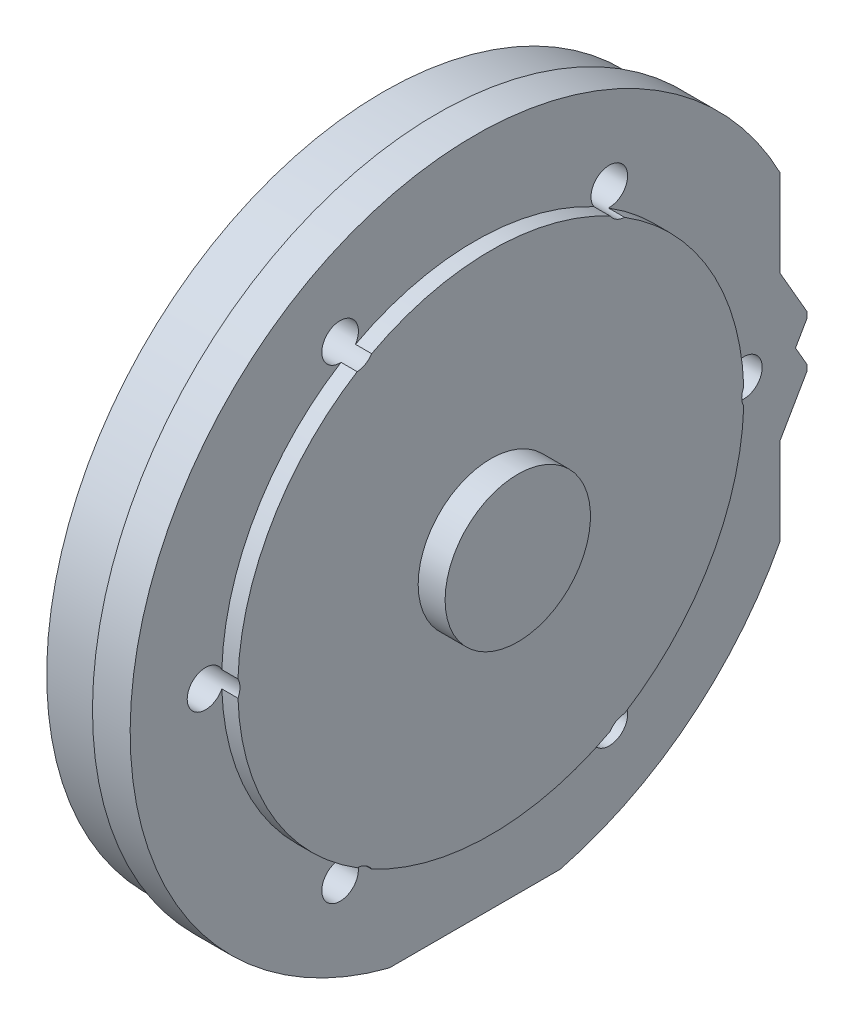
ISO-10303-21;
HEADER;
FILE_DESCRIPTION(('STEP AP214'),'2;1');
FILE_NAME('part.step','',(''),(''),'','','');
FILE_SCHEMA(('AUTOMOTIVE_DESIGN { 1 0 10303 214 1 1 1 1 }'));
ENDSEC;
DATA;
#1=APPLICATION_CONTEXT('core data for automotive mechanical design processes');
#2=APPLICATION_PROTOCOL_DEFINITION('international standard','automotive_design',2000,#1);
#3=PRODUCT_CONTEXT('',#1,'mechanical');
#4=PRODUCT('Part','Part','',(#3));
#5=PRODUCT_RELATED_PRODUCT_CATEGORY('part','',(#4));
#6=PRODUCT_DEFINITION_FORMATION('','',#4);
#7=PRODUCT_DEFINITION_CONTEXT('part definition',#1,'design');
#8=PRODUCT_DEFINITION('design','',#6,#7);
#9=PRODUCT_DEFINITION_SHAPE('','',#8);
#10=(LENGTH_UNIT() NAMED_UNIT(*) SI_UNIT(.MILLI.,.METRE.));
#11=(NAMED_UNIT(*) PLANE_ANGLE_UNIT() SI_UNIT($,.RADIAN.));
#12=(NAMED_UNIT(*) SI_UNIT($,.STERADIAN.) SOLID_ANGLE_UNIT());
#13=UNCERTAINTY_MEASURE_WITH_UNIT(LENGTH_MEASURE(1.E-05),#10,'distance_accuracy_value','');
#14=(GEOMETRIC_REPRESENTATION_CONTEXT(3) GLOBAL_UNCERTAINTY_ASSIGNED_CONTEXT((#13)) GLOBAL_UNIT_ASSIGNED_CONTEXT((#10,
#11,#12)) REPRESENTATION_CONTEXT('',''));
#15=CARTESIAN_POINT('',(0.,0.,0.));
#16=DIRECTION('',(0.,0.,1.));
#17=DIRECTION('',(1.,0.,0.));
#18=AXIS2_PLACEMENT_3D('',#15,#16,#17);
#19=CARTESIAN_POINT('',(0.,0.,0.));
#20=DIRECTION('',(1.,0.,0.));
#21=DIRECTION('',(0.,0.,-1.));
#22=AXIS2_PLACEMENT_3D('',#19,#20,#21);
#23=PLANE('',#22);
#24=CARTESIAN_POINT('',(0.,0.,0.));
#25=DIRECTION('',(-1.,0.,0.));
#26=DIRECTION('',(0.,0.,1.));
#27=AXIS2_PLACEMENT_3D('',#24,#25,#26);
#28=CIRCLE('',#27,31.5);
#29=CARTESIAN_POINT('',(0.,0.,31.5));
#30=VERTEX_POINT('',#29);
#31=EDGE_CURVE('E451',#30,#30,#28,.T.);
#32=ORIENTED_EDGE('',*,*,#31,.F.);
#33=EDGE_LOOP('',(#32));
#34=FACE_BOUND('',#33,.T.);
#35=CARTESIAN_POINT('',(0.,50.,0.));
#36=DIRECTION('',(-1.,0.,0.));
#37=DIRECTION('',(0.,0.,1.));
#38=AXIS2_PLACEMENT_3D('',#35,#36,#37);
#39=CIRCLE('',#38,4.);
#40=CARTESIAN_POINT('',(0.,50.,4.));
#41=VERTEX_POINT('',#40);
#42=EDGE_CURVE('E439',#41,#41,#39,.T.);
#43=ORIENTED_EDGE('',*,*,#42,.F.);
#44=EDGE_LOOP('',(#43));
#45=FACE_BOUND('',#44,.T.);
#46=CARTESIAN_POINT('',(0.,0.,-50.));
#47=DIRECTION('',(-1.,0.,0.));
#48=DIRECTION('',(0.,0.,1.));
#49=AXIS2_PLACEMENT_3D('',#46,#47,#48);
#50=CIRCLE('',#49,3.4);
#51=CARTESIAN_POINT('',(0.,0.,-46.6));
#52=VERTEX_POINT('',#51);
#53=EDGE_CURVE('E423',#52,#52,#50,.T.);
#54=ORIENTED_EDGE('',*,*,#53,.F.);
#55=EDGE_LOOP('',(#54));
#56=FACE_BOUND('',#55,.T.);
#57=CARTESIAN_POINT('',(0.,43.3012701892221,-25.));
#58=DIRECTION('',(-1.,0.,0.));
#59=DIRECTION('',(0.,0.,1.));
#60=AXIS2_PLACEMENT_3D('',#57,#58,#59);
#61=CIRCLE('',#60,3.4);
#62=CARTESIAN_POINT('',(0.,43.3012701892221,-21.6));
#63=VERTEX_POINT('',#62);
#64=EDGE_CURVE('E407',#63,#63,#61,.T.);
#65=ORIENTED_EDGE('',*,*,#64,.F.);
#66=EDGE_LOOP('',(#65));
#67=FACE_BOUND('',#66,.T.);
#68=CARTESIAN_POINT('',(0.,43.3012701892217,25.));
#69=DIRECTION('',(-1.,0.,0.));
#70=DIRECTION('',(0.,0.,1.));
#71=AXIS2_PLACEMENT_3D('',#68,#69,#70);
#72=CIRCLE('',#71,3.4);
#73=CARTESIAN_POINT('',(0.,43.3012701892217,28.4));
#74=VERTEX_POINT('',#73);
#75=EDGE_CURVE('E391',#74,#74,#72,.T.);
#76=ORIENTED_EDGE('',*,*,#75,.F.);
#77=EDGE_LOOP('',(#76));
#78=FACE_BOUND('',#77,.T.);
#79=CARTESIAN_POINT('',(0.,-4.44089209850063E-13,50.));
#80=DIRECTION('',(-1.,0.,0.));
#81=DIRECTION('',(0.,0.,1.));
#82=AXIS2_PLACEMENT_3D('',#79,#80,#81);
#83=CIRCLE('',#82,3.4);
#84=CARTESIAN_POINT('',(0.,-4.44089209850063E-13,53.4));
#85=VERTEX_POINT('',#84);
#86=EDGE_CURVE('E376',#85,#85,#83,.T.);
#87=ORIENTED_EDGE('',*,*,#86,.F.);
#88=EDGE_LOOP('',(#87));
#89=FACE_BOUND('',#88,.T.);
#90=CARTESIAN_POINT('',(0.,-43.3012701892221,24.9999999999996));
#91=DIRECTION('',(-1.,0.,0.));
#92=DIRECTION('',(0.,0.,1.));
#93=AXIS2_PLACEMENT_3D('',#90,#91,#92);
#94=CIRCLE('',#93,3.4);
#95=CARTESIAN_POINT('',(0.,-43.3012701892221,28.3999999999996));
#96=VERTEX_POINT('',#95);
#97=EDGE_CURVE('E364',#96,#96,#94,.T.);
#98=ORIENTED_EDGE('',*,*,#97,.F.);
#99=EDGE_LOOP('',(#98));
#100=FACE_BOUND('',#99,.T.);
#101=CARTESIAN_POINT('',(0.,-43.3012701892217,-25.0000000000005));
#102=DIRECTION('',(-1.,0.,0.));
#103=DIRECTION('',(0.,0.,1.));
#104=AXIS2_PLACEMENT_3D('',#101,#102,#103);
#105=CIRCLE('',#104,3.4);
#106=CARTESIAN_POINT('',(0.,-43.3012701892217,-21.6000000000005));
#107=VERTEX_POINT('',#106);
#108=EDGE_CURVE('E348',#107,#107,#105,.T.);
#109=ORIENTED_EDGE('',*,*,#108,.F.);
#110=EDGE_LOOP('',(#109));
#111=FACE_BOUND('',#110,.T.);
#112=DIRECTION('',(0.,-1.,0.));
#113=VECTOR('',#112,1.);
#114=CARTESIAN_POINT('',(0.,-13.4102540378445,-56.75));
#115=LINE('',#114,#113);
#116=CARTESIAN_POINT('',(0.,-13.4102540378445,-56.75));
#117=VERTEX_POINT('',#116);
#118=CARTESIAN_POINT('',(0.,-26.1856353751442,-56.75));
#119=VERTEX_POINT('',#118);
#120=EDGE_CURVE('E289',#117,#119,#115,.T.);
#121=ORIENTED_EDGE('',*,*,#120,.T.);
#122=CARTESIAN_POINT('',(0.,0.,0.));
#123=DIRECTION('',(-1.,0.,0.));
#124=DIRECTION('',(0.,0.,1.));
#125=AXIS2_PLACEMENT_3D('',#122,#123,#124);
#126=CIRCLE('',#125,62.5);
#127=CARTESIAN_POINT('',(0.,-62.,-7.88986691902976));
#128=VERTEX_POINT('',#127);
#129=EDGE_CURVE('E489',#119,#128,#126,.T.);
#130=ORIENTED_EDGE('',*,*,#129,.T.);
#131=DIRECTION('',(0.,0.,1.));
#132=VECTOR('',#131,1.);
#133=CARTESIAN_POINT('',(0.,-62.,25.));
#134=LINE('',#133,#132);
#135=CARTESIAN_POINT('',(0.,-62.,7.88986691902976));
#136=VERTEX_POINT('',#135);
#137=EDGE_CURVE('E331',#128,#136,#134,.T.);
#138=ORIENTED_EDGE('',*,*,#137,.T.);
#139=CARTESIAN_POINT('',(0.,26.1856353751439,-56.75));
#140=VERTEX_POINT('',#139);
#141=EDGE_CURVE('E263',#136,#140,#126,.T.);
#142=ORIENTED_EDGE('',*,*,#141,.T.);
#143=DIRECTION('',(0.,-1.,0.));
#144=VECTOR('',#143,1.);
#145=CARTESIAN_POINT('',(0.,29.5877930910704,-56.75));
#146=LINE('',#145,#144);
#147=CARTESIAN_POINT('',(0.,13.4102540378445,-56.75));
#148=VERTEX_POINT('',#147);
#149=EDGE_CURVE('E241',#140,#148,#146,.T.);
#150=ORIENTED_EDGE('',*,*,#149,.T.);
#151=DIRECTION('',(0.,-0.866025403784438,-0.5));
#152=VECTOR('',#151,1.);
#153=CARTESIAN_POINT('',(0.,13.4102540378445,-56.75));
#154=LINE('',#153,#152);
#155=CARTESIAN_POINT('',(0.,4.75,-61.75));
#156=VERTEX_POINT('',#155);
#157=EDGE_CURVE('E250',#148,#156,#154,.T.);
#158=ORIENTED_EDGE('',*,*,#157,.T.);
#159=DIRECTION('',(0.,-1.,0.));
#160=VECTOR('',#159,1.);
#161=CARTESIAN_POINT('',(0.,4.75,-61.75));
#162=LINE('',#161,#160);
#163=CARTESIAN_POINT('',(0.,3.75000000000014,-61.75));
#164=VERTEX_POINT('',#163);
#165=EDGE_CURVE('E257',#156,#164,#162,.T.);
#166=ORIENTED_EDGE('',*,*,#165,.T.);
#167=DIRECTION('',(0.,-0.866025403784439,0.5));
#168=VECTOR('',#167,1.);
#169=CARTESIAN_POINT('',(0.,3.75000000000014,-61.75));
#170=LINE('',#169,#168);
#171=CARTESIAN_POINT('',(0.,0.,-59.5849364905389));
#172=VERTEX_POINT('',#171);
#173=EDGE_CURVE('E273',#164,#172,#170,.T.);
#174=ORIENTED_EDGE('',*,*,#173,.T.);
#175=DIRECTION('',(0.,-0.866025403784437,-0.5));
#176=VECTOR('',#175,1.);
#177=CARTESIAN_POINT('',(0.,0.,-59.5849364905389));
#178=LINE('',#177,#176);
#179=CARTESIAN_POINT('',(0.,-3.75000000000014,-61.75));
#180=VERTEX_POINT('',#179);
#181=EDGE_CURVE('E277',#172,#180,#178,.T.);
#182=ORIENTED_EDGE('',*,*,#181,.T.);
#183=DIRECTION('',(0.,-1.,0.));
#184=VECTOR('',#183,1.);
#185=CARTESIAN_POINT('',(0.,-3.75000000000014,-61.75));
#186=LINE('',#185,#184);
#187=CARTESIAN_POINT('',(0.,-4.75,-61.75));
#188=VERTEX_POINT('',#187);
#189=EDGE_CURVE('E281',#180,#188,#186,.T.);
#190=ORIENTED_EDGE('',*,*,#189,.T.);
#191=DIRECTION('',(0.,-0.866025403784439,0.5));
#192=VECTOR('',#191,1.);
#193=CARTESIAN_POINT('',(0.,-4.75,-61.75));
#194=LINE('',#193,#192);
#195=EDGE_CURVE('E285',#188,#117,#194,.T.);
#196=ORIENTED_EDGE('',*,*,#195,.T.);
#197=EDGE_LOOP('',(#121,#130,#138,#142,#150,#158,#166,#174,#182,#190,#196));
#198=FACE_BOUND('',#197,.T.);
#199=ADVANCED_FACE('F15',(#34,#45,#56,#67,#78,#89,#100,#111,#198),#23,.F.);
#200=CARTESIAN_POINT('',(0.,0.,0.));
#201=DIRECTION('',(-1.,0.,0.));
#202=DIRECTION('',(0.,0.,1.));
#203=AXIS2_PLACEMENT_3D('',#200,#201,#202);
#204=CYLINDRICAL_SURFACE('',#203,62.5);
#205=DIRECTION('',(-1.,0.,0.));
#206=VECTOR('',#205,1.);
#207=CARTESIAN_POINT('',(0.,-26.1856353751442,-56.75));
#208=LINE('',#207,#206);
#209=CARTESIAN_POINT('',(10.,-26.1856353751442,-56.75));
#210=VERTEX_POINT('',#209);
#211=EDGE_CURVE('E328',#210,#119,#208,.T.);
#212=ORIENTED_EDGE('',*,*,#211,.F.);
#213=CARTESIAN_POINT('',(10.,0.,0.));
#214=DIRECTION('',(-1.,0.,0.));
#215=DIRECTION('',(0.,0.,1.));
#216=AXIS2_PLACEMENT_3D('',#213,#214,#215);
#217=CIRCLE('',#216,62.5);
#218=CARTESIAN_POINT('',(10.,-62.,-7.88986691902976));
#219=VERTEX_POINT('',#218);
#220=EDGE_CURVE('E484',#210,#219,#217,.T.);
#221=ORIENTED_EDGE('',*,*,#220,.T.);
#222=DIRECTION('',(-1.,0.,0.));
#223=VECTOR('',#222,1.);
#224=CARTESIAN_POINT('',(0.,-62.,-7.88986691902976));
#225=LINE('',#224,#223);
#226=EDGE_CURVE('E345',#219,#128,#225,.T.);
#227=ORIENTED_EDGE('',*,*,#226,.T.);
#228=ORIENTED_EDGE('',*,*,#129,.F.);
#229=EDGE_LOOP('',(#212,#221,#227,#228));
#230=FACE_BOUND('',#229,.T.);
#231=ADVANCED_FACE('F590',(#230),#204,.T.);
#232=DIRECTION('',(-1.,0.,0.));
#233=VECTOR('',#232,1.);
#234=CARTESIAN_POINT('',(0.,26.1856353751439,-56.75));
#235=LINE('',#234,#233);
#236=CARTESIAN_POINT('',(10.,26.1856353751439,-56.75));
#237=VERTEX_POINT('',#236);
#238=EDGE_CURVE('E322',#140,#237,#235,.F.);
#239=ORIENTED_EDGE('',*,*,#238,.F.);
#240=ORIENTED_EDGE('',*,*,#141,.F.);
#241=DIRECTION('',(-1.,0.,0.));
#242=VECTOR('',#241,1.);
#243=CARTESIAN_POINT('',(0.,-62.,7.88986691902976));
#244=LINE('',#243,#242);
#245=CARTESIAN_POINT('',(10.,-62.,7.88986691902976));
#246=VERTEX_POINT('',#245);
#247=EDGE_CURVE('E339',#136,#246,#244,.F.);
#248=ORIENTED_EDGE('',*,*,#247,.T.);
#249=EDGE_CURVE('E485',#246,#237,#217,.T.);
#250=ORIENTED_EDGE('',*,*,#249,.T.);
#251=EDGE_LOOP('',(#239,#240,#248,#250));
#252=FACE_BOUND('',#251,.T.);
#253=ADVANCED_FACE('F597',(#252),#204,.T.);
#254=CARTESIAN_POINT('',(10.,62.5,0.));
#255=DIRECTION('',(1.,0.,0.));
#256=DIRECTION('',(0.,0.,-1.));
#257=AXIS2_PLACEMENT_3D('',#254,#255,#256);
#258=PLANE('',#257);
#259=DIRECTION('',(0.,1.,0.));
#260=VECTOR('',#259,1.);
#261=CARTESIAN_POINT('',(10.,62.5,-56.75));
#262=LINE('',#261,#260);
#263=CARTESIAN_POINT('',(10.,-29.5877930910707,-56.75));
#264=VERTEX_POINT('',#263);
#265=EDGE_CURVE('E325',#264,#210,#262,.T.);
#266=ORIENTED_EDGE('',*,*,#265,.F.);
#267=CARTESIAN_POINT('',(10.,0.,0.));
#268=DIRECTION('',(-1.,0.,0.));
#269=DIRECTION('',(0.,0.,1.));
#270=AXIS2_PLACEMENT_3D('',#267,#268,#269);
#271=CIRCLE('',#270,64.);
#272=CARTESIAN_POINT('',(10.,-62.,-15.8745078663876));
#273=VERTEX_POINT('',#272);
#274=EDGE_CURVE('E479',#264,#273,#271,.T.);
#275=ORIENTED_EDGE('',*,*,#274,.T.);
#276=DIRECTION('',(0.,0.,1.));
#277=VECTOR('',#276,1.);
#278=CARTESIAN_POINT('',(10.,-62.,0.));
#279=LINE('',#278,#277);
#280=EDGE_CURVE('E340',#273,#219,#279,.T.);
#281=ORIENTED_EDGE('',*,*,#280,.T.);
#282=ORIENTED_EDGE('',*,*,#220,.F.);
#283=EDGE_LOOP('',(#266,#275,#281,#282));
#284=FACE_BOUND('',#283,.T.);
#285=ADVANCED_FACE('F685',(#284),#258,.F.);
#286=DIRECTION('',(0.,1.,0.));
#287=VECTOR('',#286,1.);
#288=CARTESIAN_POINT('',(10.,62.5,-56.75));
#289=LINE('',#288,#287);
#290=CARTESIAN_POINT('',(10.,29.5877930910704,-56.75));
#291=VERTEX_POINT('',#290);
#292=EDGE_CURVE('E319',#237,#291,#289,.T.);
#293=ORIENTED_EDGE('',*,*,#292,.F.);
#294=ORIENTED_EDGE('',*,*,#249,.F.);
#295=CARTESIAN_POINT('',(10.,-62.,15.8745078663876));
#296=VERTEX_POINT('',#295);
#297=EDGE_CURVE('E336',#246,#296,#279,.T.);
#298=ORIENTED_EDGE('',*,*,#297,.T.);
#299=EDGE_CURVE('E480',#296,#291,#271,.T.);
#300=ORIENTED_EDGE('',*,*,#299,.T.);
#301=EDGE_LOOP('',(#293,#294,#298,#300));
#302=FACE_BOUND('',#301,.T.);
#303=ADVANCED_FACE('F684',(#302),#258,.F.);
#304=CARTESIAN_POINT('',(0.,0.,0.));
#305=DIRECTION('',(-1.,0.,0.));
#306=DIRECTION('',(0.,0.,1.));
#307=AXIS2_PLACEMENT_3D('',#304,#305,#306);
#308=CYLINDRICAL_SURFACE('',#307,64.);
#309=DIRECTION('',(-1.,0.,0.));
#310=VECTOR('',#309,1.);
#311=CARTESIAN_POINT('',(76.6180551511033,-29.5877930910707,-56.75));
#312=LINE('',#311,#310);
#313=CARTESIAN_POINT('',(17.,-29.5877930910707,-56.75));
#314=VERTEX_POINT('',#313);
#315=EDGE_CURVE('E292',#314,#264,#312,.T.);
#316=ORIENTED_EDGE('',*,*,#315,.F.);
#317=CARTESIAN_POINT('',(17.,0.,0.));
#318=DIRECTION('',(-1.,0.,0.));
#319=DIRECTION('',(0.,0.,1.));
#320=AXIS2_PLACEMENT_3D('',#317,#318,#319);
#321=CIRCLE('',#320,64.);
#322=CARTESIAN_POINT('',(17.,-62.,-15.8745078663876));
#323=VERTEX_POINT('',#322);
#324=EDGE_CURVE('E41',#314,#323,#321,.T.);
#325=ORIENTED_EDGE('',*,*,#324,.T.);
#326=DIRECTION('',(-1.,0.,0.));
#327=VECTOR('',#326,1.);
#328=CARTESIAN_POINT('',(0.,-62.,-15.8745078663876));
#329=LINE('',#328,#327);
#330=EDGE_CURVE('E343',#323,#273,#329,.T.);
#331=ORIENTED_EDGE('',*,*,#330,.T.);
#332=ORIENTED_EDGE('',*,*,#274,.F.);
#333=EDGE_LOOP('',(#316,#325,#331,#332));
#334=FACE_BOUND('',#333,.T.);
#335=ADVANCED_FACE('F679',(#334),#308,.T.);
#336=DIRECTION('',(-1.,0.,0.));
#337=VECTOR('',#336,1.);
#338=CARTESIAN_POINT('',(76.6180551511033,29.5877930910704,-56.75));
#339=LINE('',#338,#337);
#340=CARTESIAN_POINT('',(17.,29.5877930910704,-56.75));
#341=VERTEX_POINT('',#340);
#342=EDGE_CURVE('E33',#341,#291,#339,.T.);
#343=ORIENTED_EDGE('',*,*,#342,.T.);
#344=ORIENTED_EDGE('',*,*,#299,.F.);
#345=DIRECTION('',(-1.,0.,0.));
#346=VECTOR('',#345,1.);
#347=CARTESIAN_POINT('',(0.,-62.,15.8745078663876));
#348=LINE('',#347,#346);
#349=CARTESIAN_POINT('',(17.,-62.,15.8745078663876));
#350=VERTEX_POINT('',#349);
#351=EDGE_CURVE('E333',#296,#350,#348,.F.);
#352=ORIENTED_EDGE('',*,*,#351,.T.);
#353=EDGE_CURVE('E475',#350,#341,#321,.T.);
#354=ORIENTED_EDGE('',*,*,#353,.T.);
#355=EDGE_LOOP('',(#343,#344,#352,#354));
#356=FACE_BOUND('',#355,.T.);
#357=ADVANCED_FACE('F677',(#356),#308,.T.);
#358=CARTESIAN_POINT('',(17.,64.,0.));
#359=DIRECTION('',(-1.,0.,0.));
#360=DIRECTION('',(0.,0.,1.));
#361=AXIS2_PLACEMENT_3D('',#358,#359,#360);
#362=PLANE('',#361);
#363=CARTESIAN_POINT('',(17.,0.,0.));
#364=DIRECTION('',(-1.,0.,0.));
#365=DIRECTION('',(0.,0.,1.));
#366=AXIS2_PLACEMENT_3D('',#363,#364,#365);
#367=CIRCLE('',#366,47.);
#368=CARTESIAN_POINT('',(17.,-1.5510463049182,-46.9744));
#369=VERTEX_POINT('',#368);
#370=CARTESIAN_POINT('',(17.,-39.9055005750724,-24.8304455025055));
#371=VERTEX_POINT('',#370);
#372=EDGE_CURVE('E470',#369,#371,#367,.T.);
#373=ORIENTED_EDGE('',*,*,#372,.T.);
#374=CARTESIAN_POINT('',(17.,-43.3012701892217,-25.0000000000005));
#375=DIRECTION('',(-1.,0.,0.));
#376=DIRECTION('',(0.,0.,1.));
#377=AXIS2_PLACEMENT_3D('',#374,#375,#376);
#378=CIRCLE('',#377,3.4);
#379=CARTESIAN_POINT('',(17.,-41.4565468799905,-22.1439544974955));
#380=VERTEX_POINT('',#379);
#381=EDGE_CURVE('E360',#371,#380,#378,.T.);
#382=ORIENTED_EDGE('',*,*,#381,.T.);
#383=CARTESIAN_POINT('',(17.,-41.456546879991,22.1439544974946));
#384=VERTEX_POINT('',#383);
#385=EDGE_CURVE('E474',#380,#384,#367,.T.);
#386=ORIENTED_EDGE('',*,*,#385,.T.);
#387=CARTESIAN_POINT('',(17.,-43.3012701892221,24.9999999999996));
#388=DIRECTION('',(-1.,0.,0.));
#389=DIRECTION('',(0.,0.,1.));
#390=AXIS2_PLACEMENT_3D('',#387,#388,#389);
#391=CIRCLE('',#390,3.4);
#392=CARTESIAN_POINT('',(17.,-39.9055005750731,24.8304455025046));
#393=VERTEX_POINT('',#392);
#394=EDGE_CURVE('E373',#384,#393,#391,.T.);
#395=ORIENTED_EDGE('',*,*,#394,.T.);
#396=CARTESIAN_POINT('',(17.,-1.5510463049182,46.9744));
#397=VERTEX_POINT('',#396);
#398=EDGE_CURVE('E538',#393,#397,#367,.T.);
#399=ORIENTED_EDGE('',*,*,#398,.T.);
#400=CARTESIAN_POINT('',(17.,-4.44089209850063E-13,50.));
#401=DIRECTION('',(-1.,0.,0.));
#402=DIRECTION('',(0.,0.,1.));
#403=AXIS2_PLACEMENT_3D('',#400,#401,#402);
#404=CIRCLE('',#403,3.4);
#405=CARTESIAN_POINT('',(17.,1.55104630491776,46.9744));
#406=VERTEX_POINT('',#405);
#407=EDGE_CURVE('E387',#397,#406,#404,.T.);
#408=ORIENTED_EDGE('',*,*,#407,.T.);
#409=CARTESIAN_POINT('',(17.,39.9055005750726,24.8304455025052));
#410=VERTEX_POINT('',#409);
#411=EDGE_CURVE('E534',#406,#410,#367,.T.);
#412=ORIENTED_EDGE('',*,*,#411,.T.);
#413=CARTESIAN_POINT('',(17.,43.3012701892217,25.));
#414=DIRECTION('',(-1.,0.,0.));
#415=DIRECTION('',(0.,0.,1.));
#416=AXIS2_PLACEMENT_3D('',#413,#414,#415);
#417=CIRCLE('',#416,3.4);
#418=CARTESIAN_POINT('',(17.,41.4565468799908,22.1439544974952));
#419=VERTEX_POINT('',#418);
#420=EDGE_CURVE('E403',#410,#419,#417,.T.);
#421=ORIENTED_EDGE('',*,*,#420,.T.);
#422=CARTESIAN_POINT('',(17.,41.4565468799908,-22.1439544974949));
#423=VERTEX_POINT('',#422);
#424=EDGE_CURVE('E532',#419,#423,#367,.T.);
#425=ORIENTED_EDGE('',*,*,#424,.T.);
#426=CARTESIAN_POINT('',(17.,43.3012701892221,-25.));
#427=DIRECTION('',(-1.,0.,0.));
#428=DIRECTION('',(0.,0.,1.));
#429=AXIS2_PLACEMENT_3D('',#426,#427,#428);
#430=CIRCLE('',#429,3.4);
#431=CARTESIAN_POINT('',(17.,39.9055005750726,-24.8304455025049));
#432=VERTEX_POINT('',#431);
#433=EDGE_CURVE('E419',#423,#432,#430,.T.);
#434=ORIENTED_EDGE('',*,*,#433,.T.);
#435=CARTESIAN_POINT('',(17.,1.5510463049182,-46.9744));
#436=VERTEX_POINT('',#435);
#437=EDGE_CURVE('E468',#432,#436,#367,.T.);
#438=ORIENTED_EDGE('',*,*,#437,.T.);
#439=CARTESIAN_POINT('',(17.,0.,-50.));
#440=DIRECTION('',(-1.,0.,0.));
#441=DIRECTION('',(0.,0.,1.));
#442=AXIS2_PLACEMENT_3D('',#439,#440,#441);
#443=CIRCLE('',#442,3.4);
#444=EDGE_CURVE('E435',#436,#369,#443,.T.);
#445=ORIENTED_EDGE('',*,*,#444,.T.);
#446=EDGE_LOOP('',(#373,#382,#386,#395,#399,#408,#412,#421,#425,#434,#438,#445));
#447=FACE_BOUND('',#446,.T.);
#448=DIRECTION('',(0.,1.,0.));
#449=VECTOR('',#448,1.);
#450=CARTESIAN_POINT('',(17.,-13.4102540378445,-56.75));
#451=LINE('',#450,#449);
#452=CARTESIAN_POINT('',(17.,-13.4102540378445,-56.75));
#453=VERTEX_POINT('',#452);
#454=EDGE_CURVE('E314',#314,#453,#451,.T.);
#455=ORIENTED_EDGE('',*,*,#454,.T.);
#456=DIRECTION('',(0.,0.866025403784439,-0.5));
#457=VECTOR('',#456,1.);
#458=CARTESIAN_POINT('',(17.,-4.75,-61.75));
#459=LINE('',#458,#457);
#460=CARTESIAN_POINT('',(17.,-4.75,-61.75));
#461=VERTEX_POINT('',#460);
#462=EDGE_CURVE('E318',#453,#461,#459,.T.);
#463=ORIENTED_EDGE('',*,*,#462,.T.);
#464=DIRECTION('',(0.,1.,0.));
#465=VECTOR('',#464,1.);
#466=CARTESIAN_POINT('',(17.,-3.75000000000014,-61.75));
#467=LINE('',#466,#465);
#468=CARTESIAN_POINT('',(17.,-3.75000000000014,-61.75));
#469=VERTEX_POINT('',#468);
#470=EDGE_CURVE('E730',#461,#469,#467,.T.);
#471=ORIENTED_EDGE('',*,*,#470,.T.);
#472=DIRECTION('',(0.,0.866025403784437,0.5));
#473=VECTOR('',#472,1.);
#474=CARTESIAN_POINT('',(17.,0.,-59.5849364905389));
#475=LINE('',#474,#473);
#476=CARTESIAN_POINT('',(17.,0.,-59.5849364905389));
#477=VERTEX_POINT('',#476);
#478=EDGE_CURVE('E723',#469,#477,#475,.T.);
#479=ORIENTED_EDGE('',*,*,#478,.T.);
#480=DIRECTION('',(0.,0.866025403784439,-0.5));
#481=VECTOR('',#480,1.);
#482=CARTESIAN_POINT('',(17.,3.75000000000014,-61.75));
#483=LINE('',#482,#481);
#484=CARTESIAN_POINT('',(17.,3.75000000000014,-61.75));
#485=VERTEX_POINT('',#484);
#486=EDGE_CURVE('E719',#477,#485,#483,.T.);
#487=ORIENTED_EDGE('',*,*,#486,.T.);
#488=DIRECTION('',(0.,1.,0.));
#489=VECTOR('',#488,1.);
#490=CARTESIAN_POINT('',(17.,4.75,-61.75));
#491=LINE('',#490,#489);
#492=CARTESIAN_POINT('',(17.,4.75,-61.75));
#493=VERTEX_POINT('',#492);
#494=EDGE_CURVE('E715',#485,#493,#491,.T.);
#495=ORIENTED_EDGE('',*,*,#494,.T.);
#496=DIRECTION('',(0.,0.866025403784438,0.5));
#497=VECTOR('',#496,1.);
#498=CARTESIAN_POINT('',(17.,13.4102540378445,-56.75));
#499=LINE('',#498,#497);
#500=CARTESIAN_POINT('',(17.,13.4102540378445,-56.75));
#501=VERTEX_POINT('',#500);
#502=EDGE_CURVE('E718',#493,#501,#499,.T.);
#503=ORIENTED_EDGE('',*,*,#502,.T.);
#504=DIRECTION('',(0.,1.,0.));
#505=VECTOR('',#504,1.);
#506=CARTESIAN_POINT('',(17.,29.5877930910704,-56.75));
#507=LINE('',#506,#505);
#508=EDGE_CURVE('E243',#501,#341,#507,.T.);
#509=ORIENTED_EDGE('',*,*,#508,.T.);
#510=ORIENTED_EDGE('',*,*,#353,.F.);
#511=DIRECTION('',(0.,0.,-1.));
#512=VECTOR('',#511,1.);
#513=CARTESIAN_POINT('',(17.,-62.,0.));
#514=LINE('',#513,#512);
#515=EDGE_CURVE('E10',#350,#323,#514,.T.);
#516=ORIENTED_EDGE('',*,*,#515,.T.);
#517=ORIENTED_EDGE('',*,*,#324,.F.);
#518=EDGE_LOOP('',(#455,#463,#471,#479,#487,#495,#503,#509,#510,#516,#517));
#519=FACE_BOUND('',#518,.T.);
#520=ADVANCED_FACE('F526',(#447,#519),#362,.F.);
#521=CARTESIAN_POINT('',(0.,0.,0.));
#522=DIRECTION('',(-1.,0.,0.));
#523=DIRECTION('',(0.,0.,1.));
#524=AXIS2_PLACEMENT_3D('',#521,#522,#523);
#525=CYLINDRICAL_SURFACE('',#524,47.);
#526=ORIENTED_EDGE('',*,*,#385,.F.);
#527=DIRECTION('',(-1.,0.,0.));
#528=VECTOR('',#527,1.);
#529=CARTESIAN_POINT('',(12.5,-41.4565468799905,-22.1439544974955));
#530=LINE('',#529,#528);
#531=CARTESIAN_POINT('',(20.,-41.4565468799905,-22.1439544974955));
#532=VERTEX_POINT('',#531);
#533=EDGE_CURVE('E356',#380,#532,#530,.F.);
#534=ORIENTED_EDGE('',*,*,#533,.T.);
#535=CARTESIAN_POINT('',(20.,0.,0.));
#536=DIRECTION('',(-1.,0.,0.));
#537=DIRECTION('',(0.,0.,1.));
#538=AXIS2_PLACEMENT_3D('',#535,#536,#537);
#539=CIRCLE('',#538,47.);
#540=CARTESIAN_POINT('',(20.,-41.456546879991,22.1439544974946));
#541=VERTEX_POINT('',#540);
#542=EDGE_CURVE('E469',#532,#541,#539,.T.);
#543=ORIENTED_EDGE('',*,*,#542,.T.);
#544=DIRECTION('',(-1.,0.,0.));
#545=VECTOR('',#544,1.);
#546=CARTESIAN_POINT('',(12.5,-41.456546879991,22.1439544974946));
#547=LINE('',#546,#545);
#548=EDGE_CURVE('E367',#541,#384,#547,.T.);
#549=ORIENTED_EDGE('',*,*,#548,.T.);
#550=EDGE_LOOP('',(#526,#534,#543,#549));
#551=FACE_BOUND('',#550,.T.);
#552=ADVANCED_FACE('F552',(#551),#525,.T.);
#553=ORIENTED_EDGE('',*,*,#398,.F.);
#554=DIRECTION('',(-1.,0.,0.));
#555=VECTOR('',#554,1.);
#556=CARTESIAN_POINT('',(12.5,-39.9055005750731,24.8304455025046));
#557=LINE('',#556,#555);
#558=CARTESIAN_POINT('',(20.,-39.9055005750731,24.8304455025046));
#559=VERTEX_POINT('',#558);
#560=EDGE_CURVE('E370',#393,#559,#557,.F.);
#561=ORIENTED_EDGE('',*,*,#560,.T.);
#562=CARTESIAN_POINT('',(20.,-1.5510463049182,46.9744));
#563=VERTEX_POINT('',#562);
#564=EDGE_CURVE('E554',#559,#563,#539,.T.);
#565=ORIENTED_EDGE('',*,*,#564,.T.);
#566=DIRECTION('',(-1.,0.,0.));
#567=VECTOR('',#566,1.);
#568=CARTESIAN_POINT('',(12.5,-1.5510463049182,46.9744));
#569=LINE('',#568,#567);
#570=EDGE_CURVE('E380',#563,#397,#569,.T.);
#571=ORIENTED_EDGE('',*,*,#570,.T.);
#572=EDGE_LOOP('',(#553,#561,#565,#571));
#573=FACE_BOUND('',#572,.T.);
#574=ADVANCED_FACE('F579',(#573),#525,.T.);
#575=ORIENTED_EDGE('',*,*,#411,.F.);
#576=DIRECTION('',(-1.,0.,0.));
#577=VECTOR('',#576,1.);
#578=CARTESIAN_POINT('',(12.5,1.55104630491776,46.9744));
#579=LINE('',#578,#577);
#580=CARTESIAN_POINT('',(20.,1.55104630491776,46.9744));
#581=VERTEX_POINT('',#580);
#582=EDGE_CURVE('E383',#406,#581,#579,.F.);
#583=ORIENTED_EDGE('',*,*,#582,.T.);
#584=CARTESIAN_POINT('',(20.,39.9055005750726,24.8304455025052));
#585=VERTEX_POINT('',#584);
#586=EDGE_CURVE('E555',#581,#585,#539,.T.);
#587=ORIENTED_EDGE('',*,*,#586,.T.);
#588=DIRECTION('',(-1.,0.,0.));
#589=VECTOR('',#588,1.);
#590=CARTESIAN_POINT('',(12.5,39.9055005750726,24.8304455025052));
#591=LINE('',#590,#589);
#592=EDGE_CURVE('E395',#585,#410,#591,.T.);
#593=ORIENTED_EDGE('',*,*,#592,.T.);
#594=EDGE_LOOP('',(#575,#583,#587,#593));
#595=FACE_BOUND('',#594,.T.);
#596=ADVANCED_FACE('F577',(#595),#525,.T.);
#597=ORIENTED_EDGE('',*,*,#424,.F.);
#598=DIRECTION('',(-1.,0.,0.));
#599=VECTOR('',#598,1.);
#600=CARTESIAN_POINT('',(12.5,41.4565468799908,22.1439544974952));
#601=LINE('',#600,#599);
#602=CARTESIAN_POINT('',(20.,41.4565468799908,22.1439544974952));
#603=VERTEX_POINT('',#602);
#604=EDGE_CURVE('E399',#419,#603,#601,.F.);
#605=ORIENTED_EDGE('',*,*,#604,.T.);
#606=CARTESIAN_POINT('',(20.,41.4565468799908,-22.1439544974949));
#607=VERTEX_POINT('',#606);
#608=EDGE_CURVE('E560',#603,#607,#539,.T.);
#609=ORIENTED_EDGE('',*,*,#608,.T.);
#610=DIRECTION('',(-1.,0.,0.));
#611=VECTOR('',#610,1.);
#612=CARTESIAN_POINT('',(12.5,41.4565468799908,-22.1439544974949));
#613=LINE('',#612,#611);
#614=EDGE_CURVE('E411',#607,#423,#613,.T.);
#615=ORIENTED_EDGE('',*,*,#614,.T.);
#616=EDGE_LOOP('',(#597,#605,#609,#615));
#617=FACE_BOUND('',#616,.T.);
#618=ADVANCED_FACE('F572',(#617),#525,.T.);
#619=ORIENTED_EDGE('',*,*,#437,.F.);
#620=DIRECTION('',(-1.,0.,0.));
#621=VECTOR('',#620,1.);
#622=CARTESIAN_POINT('',(12.5,39.9055005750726,-24.8304455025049));
#623=LINE('',#622,#621);
#624=CARTESIAN_POINT('',(20.,39.9055005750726,-24.8304455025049));
#625=VERTEX_POINT('',#624);
#626=EDGE_CURVE('E415',#432,#625,#623,.F.);
#627=ORIENTED_EDGE('',*,*,#626,.T.);
#628=CARTESIAN_POINT('',(20.,1.5510463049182,-46.9744));
#629=VERTEX_POINT('',#628);
#630=EDGE_CURVE('E463',#625,#629,#539,.T.);
#631=ORIENTED_EDGE('',*,*,#630,.T.);
#632=DIRECTION('',(-1.,0.,0.));
#633=VECTOR('',#632,1.);
#634=CARTESIAN_POINT('',(12.5,1.5510463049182,-46.9744));
#635=LINE('',#634,#633);
#636=EDGE_CURVE('E427',#629,#436,#635,.T.);
#637=ORIENTED_EDGE('',*,*,#636,.T.);
#638=EDGE_LOOP('',(#619,#627,#631,#637));
#639=FACE_BOUND('',#638,.T.);
#640=ADVANCED_FACE('F569',(#639),#525,.T.);
#641=CARTESIAN_POINT('',(20.,-1.5510463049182,-46.9744));
#642=VERTEX_POINT('',#641);
#643=CARTESIAN_POINT('',(20.,-39.9055005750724,-24.8304455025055));
#644=VERTEX_POINT('',#643);
#645=EDGE_CURVE('E464',#642,#644,#539,.T.);
#646=ORIENTED_EDGE('',*,*,#645,.T.);
#647=DIRECTION('',(-1.,0.,0.));
#648=VECTOR('',#647,1.);
#649=CARTESIAN_POINT('',(12.5,-39.9055005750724,-24.8304455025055));
#650=LINE('',#649,#648);
#651=EDGE_CURVE('E352',#644,#371,#650,.T.);
#652=ORIENTED_EDGE('',*,*,#651,.T.);
#653=ORIENTED_EDGE('',*,*,#372,.F.);
#654=DIRECTION('',(-1.,0.,0.));
#655=VECTOR('',#654,1.);
#656=CARTESIAN_POINT('',(12.5,-1.5510463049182,-46.9744));
#657=LINE('',#656,#655);
#658=EDGE_CURVE('E431',#369,#642,#657,.F.);
#659=ORIENTED_EDGE('',*,*,#658,.T.);
#660=EDGE_LOOP('',(#646,#652,#653,#659));
#661=FACE_BOUND('',#660,.T.);
#662=ADVANCED_FACE('F519',(#661),#525,.T.);
#663=CARTESIAN_POINT('',(20.,47.,0.));
#664=DIRECTION('',(-1.,0.,0.));
#665=DIRECTION('',(0.,0.,1.));
#666=AXIS2_PLACEMENT_3D('',#663,#664,#665);
#667=PLANE('',#666);
#668=ORIENTED_EDGE('',*,*,#542,.F.);
#669=CARTESIAN_POINT('',(20.,-43.3012701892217,-25.0000000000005));
#670=DIRECTION('',(-1.,0.,0.));
#671=DIRECTION('',(0.,0.,1.));
#672=AXIS2_PLACEMENT_3D('',#669,#670,#671);
#673=CIRCLE('',#672,3.4);
#674=EDGE_CURVE('E22',#532,#644,#673,.T.);
#675=ORIENTED_EDGE('',*,*,#674,.T.);
#676=ORIENTED_EDGE('',*,*,#645,.F.);
#677=CARTESIAN_POINT('',(20.,0.,-50.));
#678=DIRECTION('',(-1.,0.,0.));
#679=DIRECTION('',(0.,0.,1.));
#680=AXIS2_PLACEMENT_3D('',#677,#678,#679);
#681=CIRCLE('',#680,3.4);
#682=EDGE_CURVE('E492',#642,#629,#681,.T.);
#683=ORIENTED_EDGE('',*,*,#682,.T.);
#684=ORIENTED_EDGE('',*,*,#630,.F.);
#685=CARTESIAN_POINT('',(20.,43.3012701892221,-25.));
#686=DIRECTION('',(-1.,0.,0.));
#687=DIRECTION('',(0.,0.,1.));
#688=AXIS2_PLACEMENT_3D('',#685,#686,#687);
#689=CIRCLE('',#688,3.4);
#690=EDGE_CURVE('E496',#625,#607,#689,.T.);
#691=ORIENTED_EDGE('',*,*,#690,.T.);
#692=ORIENTED_EDGE('',*,*,#608,.F.);
#693=CARTESIAN_POINT('',(20.,43.3012701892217,25.));
#694=DIRECTION('',(-1.,0.,0.));
#695=DIRECTION('',(0.,0.,1.));
#696=AXIS2_PLACEMENT_3D('',#693,#694,#695);
#697=CIRCLE('',#696,3.4);
#698=EDGE_CURVE('E500',#603,#585,#697,.T.);
#699=ORIENTED_EDGE('',*,*,#698,.T.);
#700=ORIENTED_EDGE('',*,*,#586,.F.);
#701=CARTESIAN_POINT('',(20.,-4.44089209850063E-13,50.));
#702=DIRECTION('',(-1.,0.,0.));
#703=DIRECTION('',(0.,0.,1.));
#704=AXIS2_PLACEMENT_3D('',#701,#702,#703);
#705=CIRCLE('',#704,3.4);
#706=EDGE_CURVE('E504',#581,#563,#705,.T.);
#707=ORIENTED_EDGE('',*,*,#706,.T.);
#708=ORIENTED_EDGE('',*,*,#564,.F.);
#709=CARTESIAN_POINT('',(20.,-43.3012701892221,24.9999999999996));
#710=DIRECTION('',(-1.,0.,0.));
#711=DIRECTION('',(0.,0.,1.));
#712=AXIS2_PLACEMENT_3D('',#709,#710,#711);
#713=CIRCLE('',#712,3.4);
#714=EDGE_CURVE('E507',#559,#541,#713,.T.);
#715=ORIENTED_EDGE('',*,*,#714,.T.);
#716=EDGE_LOOP('',(#668,#675,#676,#683,#684,#691,#692,#699,#700,#707,#708,#715));
#717=FACE_BOUND('',#716,.T.);
#718=CARTESIAN_POINT('',(20.,0.,0.));
#719=DIRECTION('',(-1.,0.,0.));
#720=DIRECTION('',(0.,0.,1.));
#721=AXIS2_PLACEMENT_3D('',#718,#719,#720);
#722=CIRCLE('',#721,13.5);
#723=CARTESIAN_POINT('',(20.,0.,13.5));
#724=VERTEX_POINT('',#723);
#725=EDGE_CURVE('E459',#724,#724,#722,.T.);
#726=ORIENTED_EDGE('',*,*,#725,.T.);
#727=EDGE_LOOP('',(#726));
#728=FACE_BOUND('',#727,.T.);
#729=ADVANCED_FACE('F515',(#717,#728),#667,.F.);
#730=CARTESIAN_POINT('',(0.,0.,0.));
#731=DIRECTION('',(-1.,0.,0.));
#732=DIRECTION('',(0.,0.,1.));
#733=AXIS2_PLACEMENT_3D('',#730,#731,#732);
#734=CYLINDRICAL_SURFACE('',#733,13.5);
#735=ORIENTED_EDGE('',*,*,#725,.F.);
#736=EDGE_LOOP('',(#735));
#737=FACE_BOUND('',#736,.T.);
#738=CARTESIAN_POINT('',(25.,0.,0.));
#739=DIRECTION('',(-1.,0.,0.));
#740=DIRECTION('',(0.,0.,1.));
#741=AXIS2_PLACEMENT_3D('',#738,#739,#740);
#742=CIRCLE('',#741,13.5);
#743=CARTESIAN_POINT('',(25.,0.,13.5));
#744=VERTEX_POINT('',#743);
#745=EDGE_CURVE('E455',#744,#744,#742,.T.);
#746=ORIENTED_EDGE('',*,*,#745,.T.);
#747=EDGE_LOOP('',(#746));
#748=FACE_BOUND('',#747,.T.);
#749=ADVANCED_FACE('F662',(#737,#748),#734,.T.);
#750=CARTESIAN_POINT('',(25.,13.5,0.));
#751=DIRECTION('',(-1.,0.,0.));
#752=DIRECTION('',(0.,0.,1.));
#753=AXIS2_PLACEMENT_3D('',#750,#751,#752);
#754=PLANE('',#753);
#755=ORIENTED_EDGE('',*,*,#745,.F.);
#756=EDGE_LOOP('',(#755));
#757=FACE_BOUND('',#756,.T.);
#758=ADVANCED_FACE('F658',(#757),#754,.F.);
#759=CARTESIAN_POINT('',(0.,0.,0.));
#760=DIRECTION('',(-1.,0.,0.));
#761=DIRECTION('',(0.,0.,1.));
#762=AXIS2_PLACEMENT_3D('',#759,#760,#761);
#763=CYLINDRICAL_SURFACE('',#762,31.5);
#764=ORIENTED_EDGE('',*,*,#31,.T.);
#765=EDGE_LOOP('',(#764));
#766=FACE_BOUND('',#765,.T.);
#767=CARTESIAN_POINT('',(6.9999999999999,0.,0.));
#768=DIRECTION('',(-1.,0.,0.));
#769=DIRECTION('',(0.,0.,1.));
#770=AXIS2_PLACEMENT_3D('',#767,#768,#769);
#771=CIRCLE('',#770,31.5);
#772=CARTESIAN_POINT('',(6.9999999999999,0.,31.5));
#773=VERTEX_POINT('',#772);
#774=EDGE_CURVE('E447',#773,#773,#771,.T.);
#775=ORIENTED_EDGE('',*,*,#774,.F.);
#776=EDGE_LOOP('',(#775));
#777=FACE_BOUND('',#776,.T.);
#778=ADVANCED_FACE('F654',(#766,#777),#763,.F.);
#779=CARTESIAN_POINT('',(6.9999999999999,31.5,0.));
#780=DIRECTION('',(-1.,0.,0.));
#781=DIRECTION('',(0.,0.,1.));
#782=AXIS2_PLACEMENT_3D('',#779,#780,#781);
#783=PLANE('',#782);
#784=ORIENTED_EDGE('',*,*,#774,.T.);
#785=EDGE_LOOP('',(#784));
#786=FACE_BOUND('',#785,.T.);
#787=ADVANCED_FACE('F650',(#786),#783,.T.);
#788=CARTESIAN_POINT('',(12.,50.,0.));
#789=DIRECTION('',(-1.,0.,0.));
#790=DIRECTION('',(0.,0.,1.));
#791=AXIS2_PLACEMENT_3D('',#788,#789,#790);
#792=CONICAL_SURFACE('',#791,4.,1.02974425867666);
#793=CARTESIAN_POINT('',(14.4034424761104,50.,0.));
#794=VERTEX_POINT('',#793);
#795=VERTEX_LOOP('',#794);
#796=FACE_BOUND('',#795,.T.);
#797=CARTESIAN_POINT('',(12.,50.,0.));
#798=DIRECTION('',(-1.,0.,0.));
#799=DIRECTION('',(0.,0.,1.));
#800=AXIS2_PLACEMENT_3D('',#797,#798,#799);
#801=CIRCLE('',#800,4.);
#802=CARTESIAN_POINT('',(12.,50.,4.));
#803=VERTEX_POINT('',#802);
#804=EDGE_CURVE('E443',#803,#803,#801,.T.);
#805=ORIENTED_EDGE('',*,*,#804,.T.);
#806=EDGE_LOOP('',(#805));
#807=FACE_BOUND('',#806,.T.);
#808=ADVANCED_FACE('F646',(#796,#807),#792,.F.);
#809=CARTESIAN_POINT('',(0.,50.,0.));
#810=DIRECTION('',(-1.,0.,0.));
#811=DIRECTION('',(0.,0.,1.));
#812=AXIS2_PLACEMENT_3D('',#809,#810,#811);
#813=CYLINDRICAL_SURFACE('',#812,4.);
#814=ORIENTED_EDGE('',*,*,#804,.F.);
#815=EDGE_LOOP('',(#814));
#816=FACE_BOUND('',#815,.T.);
#817=ORIENTED_EDGE('',*,*,#42,.T.);
#818=EDGE_LOOP('',(#817));
#819=FACE_BOUND('',#818,.T.);
#820=ADVANCED_FACE('F642',(#816,#819),#813,.F.);
#821=CARTESIAN_POINT('',(0.,0.,-50.));
#822=DIRECTION('',(-1.,0.,0.));
#823=DIRECTION('',(0.,0.,1.));
#824=AXIS2_PLACEMENT_3D('',#821,#822,#823);
#825=CYLINDRICAL_SURFACE('',#824,3.4);
#826=ORIENTED_EDGE('',*,*,#53,.T.);
#827=EDGE_LOOP('',(#826));
#828=FACE_BOUND('',#827,.T.);
#829=ORIENTED_EDGE('',*,*,#636,.F.);
#830=ORIENTED_EDGE('',*,*,#682,.F.);
#831=ORIENTED_EDGE('',*,*,#658,.F.);
#832=ORIENTED_EDGE('',*,*,#444,.F.);
#833=EDGE_LOOP('',(#829,#830,#831,#832));
#834=FACE_BOUND('',#833,.T.);
#835=ADVANCED_FACE('F524',(#828,#834),#825,.F.);
#836=CARTESIAN_POINT('',(0.,43.3012701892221,-25.));
#837=DIRECTION('',(-1.,0.,0.));
#838=DIRECTION('',(0.,0.,1.));
#839=AXIS2_PLACEMENT_3D('',#836,#837,#838);
#840=CYLINDRICAL_SURFACE('',#839,3.4);
#841=ORIENTED_EDGE('',*,*,#64,.T.);
#842=EDGE_LOOP('',(#841));
#843=FACE_BOUND('',#842,.T.);
#844=ORIENTED_EDGE('',*,*,#614,.F.);
#845=ORIENTED_EDGE('',*,*,#690,.F.);
#846=ORIENTED_EDGE('',*,*,#626,.F.);
#847=ORIENTED_EDGE('',*,*,#433,.F.);
#848=EDGE_LOOP('',(#844,#845,#846,#847));
#849=FACE_BOUND('',#848,.T.);
#850=ADVANCED_FACE('F571',(#843,#849),#840,.F.);
#851=CARTESIAN_POINT('',(0.,43.3012701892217,25.));
#852=DIRECTION('',(-1.,0.,0.));
#853=DIRECTION('',(0.,0.,1.));
#854=AXIS2_PLACEMENT_3D('',#851,#852,#853);
#855=CYLINDRICAL_SURFACE('',#854,3.4);
#856=ORIENTED_EDGE('',*,*,#75,.T.);
#857=EDGE_LOOP('',(#856));
#858=FACE_BOUND('',#857,.T.);
#859=ORIENTED_EDGE('',*,*,#592,.F.);
#860=ORIENTED_EDGE('',*,*,#698,.F.);
#861=ORIENTED_EDGE('',*,*,#604,.F.);
#862=ORIENTED_EDGE('',*,*,#420,.F.);
#863=EDGE_LOOP('',(#859,#860,#861,#862));
#864=FACE_BOUND('',#863,.T.);
#865=ADVANCED_FACE('F574',(#858,#864),#855,.F.);
#866=CARTESIAN_POINT('',(0.,-4.44089209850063E-13,50.));
#867=DIRECTION('',(-1.,0.,0.));
#868=DIRECTION('',(0.,0.,1.));
#869=AXIS2_PLACEMENT_3D('',#866,#867,#868);
#870=CYLINDRICAL_SURFACE('',#869,3.4);
#871=ORIENTED_EDGE('',*,*,#86,.T.);
#872=EDGE_LOOP('',(#871));
#873=FACE_BOUND('',#872,.T.);
#874=ORIENTED_EDGE('',*,*,#570,.F.);
#875=ORIENTED_EDGE('',*,*,#706,.F.);
#876=ORIENTED_EDGE('',*,*,#582,.F.);
#877=ORIENTED_EDGE('',*,*,#407,.F.);
#878=EDGE_LOOP('',(#874,#875,#876,#877));
#879=FACE_BOUND('',#878,.T.);
#880=ADVANCED_FACE('F576',(#873,#879),#870,.F.);
#881=CARTESIAN_POINT('',(0.,-43.3012701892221,24.9999999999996));
#882=DIRECTION('',(-1.,0.,0.));
#883=DIRECTION('',(0.,0.,1.));
#884=AXIS2_PLACEMENT_3D('',#881,#882,#883);
#885=CYLINDRICAL_SURFACE('',#884,3.4);
#886=ORIENTED_EDGE('',*,*,#97,.T.);
#887=EDGE_LOOP('',(#886));
#888=FACE_BOUND('',#887,.T.);
#889=ORIENTED_EDGE('',*,*,#548,.F.);
#890=ORIENTED_EDGE('',*,*,#714,.F.);
#891=ORIENTED_EDGE('',*,*,#560,.F.);
#892=ORIENTED_EDGE('',*,*,#394,.F.);
#893=EDGE_LOOP('',(#889,#890,#891,#892));
#894=FACE_BOUND('',#893,.T.);
#895=ADVANCED_FACE('F551',(#888,#894),#885,.F.);
#896=CARTESIAN_POINT('',(0.,-43.3012701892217,-25.0000000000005));
#897=DIRECTION('',(-1.,0.,0.));
#898=DIRECTION('',(0.,0.,1.));
#899=AXIS2_PLACEMENT_3D('',#896,#897,#898);
#900=CYLINDRICAL_SURFACE('',#899,3.4);
#901=ORIENTED_EDGE('',*,*,#108,.T.);
#902=EDGE_LOOP('',(#901));
#903=FACE_BOUND('',#902,.T.);
#904=ORIENTED_EDGE('',*,*,#651,.F.);
#905=ORIENTED_EDGE('',*,*,#674,.F.);
#906=ORIENTED_EDGE('',*,*,#533,.F.);
#907=ORIENTED_EDGE('',*,*,#381,.F.);
#908=EDGE_LOOP('',(#904,#905,#906,#907));
#909=FACE_BOUND('',#908,.T.);
#910=ADVANCED_FACE('F615',(#903,#909),#900,.F.);
#911=CARTESIAN_POINT('',(0.,-62.,25.));
#912=DIRECTION('',(0.,1.,0.));
#913=DIRECTION('',(0.,0.,1.));
#914=AXIS2_PLACEMENT_3D('',#911,#912,#913);
#915=PLANE('',#914);
#916=ORIENTED_EDGE('',*,*,#280,.F.);
#917=ORIENTED_EDGE('',*,*,#330,.F.);
#918=ORIENTED_EDGE('',*,*,#515,.F.);
#919=ORIENTED_EDGE('',*,*,#351,.F.);
#920=ORIENTED_EDGE('',*,*,#297,.F.);
#921=ORIENTED_EDGE('',*,*,#247,.F.);
#922=ORIENTED_EDGE('',*,*,#137,.F.);
#923=ORIENTED_EDGE('',*,*,#226,.F.);
#924=EDGE_LOOP('',(#916,#917,#918,#919,#920,#921,#922,#923));
#925=FACE_BOUND('',#924,.T.);
#926=ADVANCED_FACE('F617',(#925),#915,.F.);
#927=CARTESIAN_POINT('',(76.6180551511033,-13.4102540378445,-56.75));
#928=DIRECTION('',(0.,0.,-1.));
#929=DIRECTION('',(0.,1.,0.));
#930=AXIS2_PLACEMENT_3D('',#927,#928,#929);
#931=PLANE('',#930);
#932=ORIENTED_EDGE('',*,*,#211,.T.);
#933=ORIENTED_EDGE('',*,*,#120,.F.);
#934=DIRECTION('',(-1.,0.,0.));
#935=VECTOR('',#934,1.);
#936=CARTESIAN_POINT('',(76.6180551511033,-13.4102540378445,-56.75));
#937=LINE('',#936,#935);
#938=EDGE_CURVE('E295',#453,#117,#937,.T.);
#939=ORIENTED_EDGE('',*,*,#938,.F.);
#940=ORIENTED_EDGE('',*,*,#454,.F.);
#941=ORIENTED_EDGE('',*,*,#315,.T.);
#942=ORIENTED_EDGE('',*,*,#265,.T.);
#943=EDGE_LOOP('',(#932,#933,#939,#940,#941,#942));
#944=FACE_BOUND('',#943,.T.);
#945=ADVANCED_FACE('F624',(#944),#931,.T.);
#946=CARTESIAN_POINT('',(76.6180551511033,29.5877930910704,-56.75));
#947=DIRECTION('',(0.,0.,-1.));
#948=DIRECTION('',(0.,1.,0.));
#949=AXIS2_PLACEMENT_3D('',#946,#947,#948);
#950=PLANE('',#949);
#951=ORIENTED_EDGE('',*,*,#238,.T.);
#952=ORIENTED_EDGE('',*,*,#292,.T.);
#953=ORIENTED_EDGE('',*,*,#342,.F.);
#954=ORIENTED_EDGE('',*,*,#508,.F.);
#955=DIRECTION('',(-1.,0.,0.));
#956=VECTOR('',#955,1.);
#957=CARTESIAN_POINT('',(76.6180551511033,13.4102540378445,-56.75));
#958=LINE('',#957,#956);
#959=EDGE_CURVE('E237',#501,#148,#958,.T.);
#960=ORIENTED_EDGE('',*,*,#959,.T.);
#961=ORIENTED_EDGE('',*,*,#149,.F.);
#962=EDGE_LOOP('',(#951,#952,#953,#954,#960,#961));
#963=FACE_BOUND('',#962,.T.);
#964=ADVANCED_FACE('F239',(#963),#950,.T.);
#965=CARTESIAN_POINT('',(76.6180551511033,-4.75,-61.75));
#966=DIRECTION('',(0.,-0.5,-0.866025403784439));
#967=DIRECTION('',(0.,0.866025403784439,-0.5));
#968=AXIS2_PLACEMENT_3D('',#965,#966,#967);
#969=PLANE('',#968);
#970=ORIENTED_EDGE('',*,*,#938,.T.);
#971=ORIENTED_EDGE('',*,*,#195,.F.);
#972=DIRECTION('',(-1.,0.,0.));
#973=VECTOR('',#972,1.);
#974=CARTESIAN_POINT('',(76.6180551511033,-4.75,-61.75));
#975=LINE('',#974,#973);
#976=EDGE_CURVE('E298',#461,#188,#975,.T.);
#977=ORIENTED_EDGE('',*,*,#976,.F.);
#978=ORIENTED_EDGE('',*,*,#462,.F.);
#979=EDGE_LOOP('',(#970,#971,#977,#978));
#980=FACE_BOUND('',#979,.T.);
#981=ADVANCED_FACE('F739',(#980),#969,.T.);
#982=CARTESIAN_POINT('',(76.6180551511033,-3.75000000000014,-61.75));
#983=DIRECTION('',(0.,0.,-1.));
#984=DIRECTION('',(0.,1.,0.));
#985=AXIS2_PLACEMENT_3D('',#982,#983,#984);
#986=PLANE('',#985);
#987=ORIENTED_EDGE('',*,*,#976,.T.);
#988=ORIENTED_EDGE('',*,*,#189,.F.);
#989=DIRECTION('',(-1.,0.,0.));
#990=VECTOR('',#989,1.);
#991=CARTESIAN_POINT('',(76.6180551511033,-3.75000000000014,-61.75));
#992=LINE('',#991,#990);
#993=EDGE_CURVE('E301',#469,#180,#992,.T.);
#994=ORIENTED_EDGE('',*,*,#993,.F.);
#995=ORIENTED_EDGE('',*,*,#470,.F.);
#996=EDGE_LOOP('',(#987,#988,#994,#995));
#997=FACE_BOUND('',#996,.T.);
#998=ADVANCED_FACE('F745',(#997),#986,.T.);
#999=CARTESIAN_POINT('',(76.6180551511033,0.,-59.5849364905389));
#1000=DIRECTION('',(0.,0.5,-0.866025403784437));
#1001=DIRECTION('',(0.,0.866025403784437,0.5));
#1002=AXIS2_PLACEMENT_3D('',#999,#1000,#1001);
#1003=PLANE('',#1002);
#1004=ORIENTED_EDGE('',*,*,#993,.T.);
#1005=ORIENTED_EDGE('',*,*,#181,.F.);
#1006=DIRECTION('',(-1.,0.,0.));
#1007=VECTOR('',#1006,1.);
#1008=CARTESIAN_POINT('',(76.6180551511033,0.,-59.5849364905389));
#1009=LINE('',#1008,#1007);
#1010=EDGE_CURVE('E304',#477,#172,#1009,.T.);
#1011=ORIENTED_EDGE('',*,*,#1010,.F.);
#1012=ORIENTED_EDGE('',*,*,#478,.F.);
#1013=EDGE_LOOP('',(#1004,#1005,#1011,#1012));
#1014=FACE_BOUND('',#1013,.T.);
#1015=ADVANCED_FACE('F747',(#1014),#1003,.T.);
#1016=CARTESIAN_POINT('',(76.6180551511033,3.75000000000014,-61.75));
#1017=DIRECTION('',(0.,-0.5,-0.866025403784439));
#1018=DIRECTION('',(0.,0.866025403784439,-0.5));
#1019=AXIS2_PLACEMENT_3D('',#1016,#1017,#1018);
#1020=PLANE('',#1019);
#1021=ORIENTED_EDGE('',*,*,#1010,.T.);
#1022=ORIENTED_EDGE('',*,*,#173,.F.);
#1023=DIRECTION('',(-1.,0.,0.));
#1024=VECTOR('',#1023,1.);
#1025=CARTESIAN_POINT('',(76.6180551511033,3.75000000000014,-61.75));
#1026=LINE('',#1025,#1024);
#1027=EDGE_CURVE('E307',#485,#164,#1026,.T.);
#1028=ORIENTED_EDGE('',*,*,#1027,.F.);
#1029=ORIENTED_EDGE('',*,*,#486,.F.);
#1030=EDGE_LOOP('',(#1021,#1022,#1028,#1029));
#1031=FACE_BOUND('',#1030,.T.);
#1032=ADVANCED_FACE('F751',(#1031),#1020,.T.);
#1033=CARTESIAN_POINT('',(76.6180551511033,4.75,-61.75));
#1034=DIRECTION('',(0.,0.,-1.));
#1035=DIRECTION('',(0.,1.,0.));
#1036=AXIS2_PLACEMENT_3D('',#1033,#1034,#1035);
#1037=PLANE('',#1036);
#1038=ORIENTED_EDGE('',*,*,#1027,.T.);
#1039=ORIENTED_EDGE('',*,*,#165,.F.);
#1040=DIRECTION('',(-1.,0.,0.));
#1041=VECTOR('',#1040,1.);
#1042=CARTESIAN_POINT('',(76.6180551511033,4.75,-61.75));
#1043=LINE('',#1042,#1041);
#1044=EDGE_CURVE('E247',#493,#156,#1043,.T.);
#1045=ORIENTED_EDGE('',*,*,#1044,.F.);
#1046=ORIENTED_EDGE('',*,*,#494,.F.);
#1047=EDGE_LOOP('',(#1038,#1039,#1045,#1046));
#1048=FACE_BOUND('',#1047,.T.);
#1049=ADVANCED_FACE('F754',(#1048),#1037,.T.);
#1050=CARTESIAN_POINT('',(76.6180551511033,13.4102540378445,-56.75));
#1051=DIRECTION('',(0.,0.5,-0.866025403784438));
#1052=DIRECTION('',(0.,0.866025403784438,0.5));
#1053=AXIS2_PLACEMENT_3D('',#1050,#1051,#1052);
#1054=PLANE('',#1053);
#1055=ORIENTED_EDGE('',*,*,#1044,.T.);
#1056=ORIENTED_EDGE('',*,*,#157,.F.);
#1057=ORIENTED_EDGE('',*,*,#959,.F.);
#1058=ORIENTED_EDGE('',*,*,#502,.F.);
#1059=EDGE_LOOP('',(#1055,#1056,#1057,#1058));
#1060=FACE_BOUND('',#1059,.T.);
#1061=ADVANCED_FACE('F251',(#1060),#1054,.T.);
#1062=CLOSED_SHELL('',(#199,#231,#253,#285,#303,#335,#357,#520,#552,#574,#596,#618,#640,#662,
#729,#749,#758,#778,#787,#808,#820,#835,#850,#865,#880,#895,#910,#926,#945,#964,#981,#998,#1015,
#1032,#1049,#1061));
#1063=MANIFOLD_SOLID_BREP('B1',#1062);
#1064=ADVANCED_BREP_SHAPE_REPRESENTATION('',(#18,#1063),#14);
#1065=SHAPE_DEFINITION_REPRESENTATION(#9,#1064);
ENDSEC;
END-ISO-10303-21;
